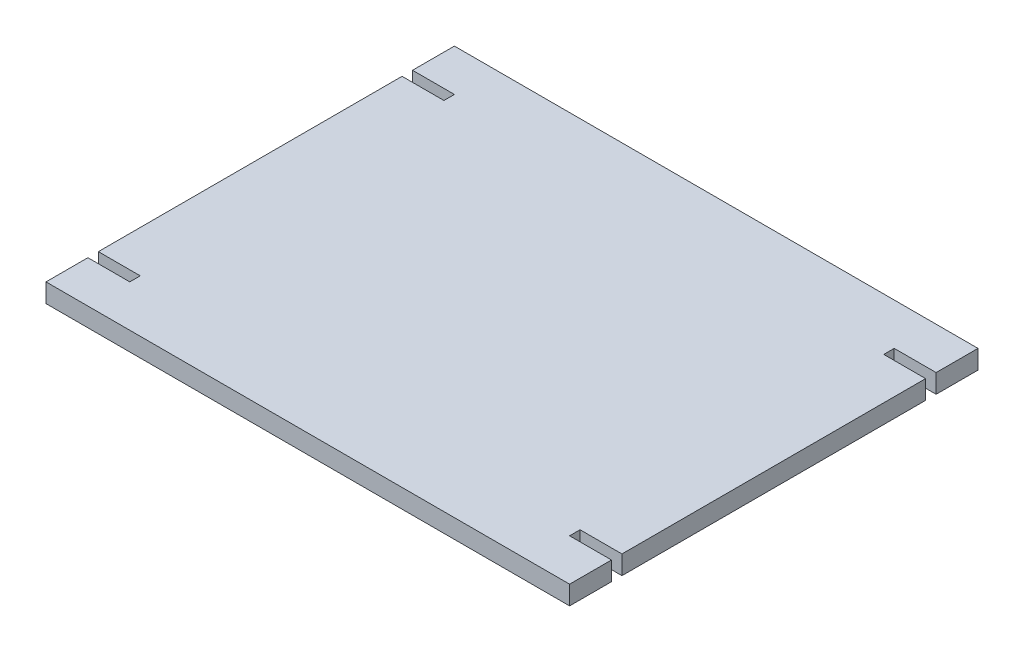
ISO-10303-21;
HEADER;
FILE_DESCRIPTION(('STEP AP214'),'2;1');
FILE_NAME('part.step','',(''),(''),'','','');
FILE_SCHEMA(('AUTOMOTIVE_DESIGN { 1 0 10303 214 1 1 1 1 }'));
ENDSEC;
DATA;
#1=APPLICATION_CONTEXT('core data for automotive mechanical design processes');
#2=APPLICATION_PROTOCOL_DEFINITION('international standard','automotive_design',2000,#1);
#3=PRODUCT_CONTEXT('',#1,'mechanical');
#4=PRODUCT('Part','Part','',(#3));
#5=PRODUCT_RELATED_PRODUCT_CATEGORY('part','',(#4));
#6=PRODUCT_DEFINITION_FORMATION('','',#4);
#7=PRODUCT_DEFINITION_CONTEXT('part definition',#1,'design');
#8=PRODUCT_DEFINITION('design','',#6,#7);
#9=PRODUCT_DEFINITION_SHAPE('','',#8);
#10=(LENGTH_UNIT() NAMED_UNIT(*) SI_UNIT(.MILLI.,.METRE.));
#11=(NAMED_UNIT(*) PLANE_ANGLE_UNIT() SI_UNIT($,.RADIAN.));
#12=(NAMED_UNIT(*) SI_UNIT($,.STERADIAN.) SOLID_ANGLE_UNIT());
#13=UNCERTAINTY_MEASURE_WITH_UNIT(LENGTH_MEASURE(1.E-05),#10,'distance_accuracy_value','');
#14=(GEOMETRIC_REPRESENTATION_CONTEXT(3) GLOBAL_UNCERTAINTY_ASSIGNED_CONTEXT((#13)) GLOBAL_UNIT_ASSIGNED_CONTEXT((#10,
#11,#12)) REPRESENTATION_CONTEXT('',''));
#15=CARTESIAN_POINT('',(0.,0.,0.));
#16=DIRECTION('',(0.,0.,1.));
#17=DIRECTION('',(1.,0.,0.));
#18=AXIS2_PLACEMENT_3D('',#15,#16,#17);
#19=CARTESIAN_POINT('',(-301.875,18.,-166.145833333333));
#20=DIRECTION('',(1.,0.,0.));
#21=DIRECTION('',(0.,0.,-1.));
#22=AXIS2_PLACEMENT_3D('',#19,#20,#21);
#23=PLANE('',#22);
#24=DIRECTION('',(0.,0.,1.));
#25=VECTOR('',#24,1.);
#26=CARTESIAN_POINT('',(-301.875,0.,-166.145833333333));
#27=LINE('',#26,#25);
#28=CARTESIAN_POINT('',(-301.875,0.,-206.145833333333));
#29=VERTEX_POINT('',#28);
#30=CARTESIAN_POINT('',(-301.875,0.,-166.145833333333));
#31=VERTEX_POINT('',#30);
#32=EDGE_CURVE('E201',#29,#31,#27,.T.);
#33=ORIENTED_EDGE('',*,*,#32,.T.);
#34=DIRECTION('',(0.,-1.,0.));
#35=VECTOR('',#34,1.);
#36=CARTESIAN_POINT('',(-301.875,18.,-166.145833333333));
#37=LINE('',#36,#35);
#38=CARTESIAN_POINT('',(-301.875,18.,-166.145833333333));
#39=VERTEX_POINT('',#38);
#40=EDGE_CURVE('E11',#39,#31,#37,.T.);
#41=ORIENTED_EDGE('',*,*,#40,.F.);
#42=DIRECTION('',(0.,0.,1.));
#43=VECTOR('',#42,1.);
#44=CARTESIAN_POINT('',(-301.875,18.,-166.145833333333));
#45=LINE('',#44,#43);
#46=CARTESIAN_POINT('',(-301.875,18.,-206.145833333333));
#47=VERTEX_POINT('',#46);
#48=EDGE_CURVE('E239',#47,#39,#45,.T.);
#49=ORIENTED_EDGE('',*,*,#48,.F.);
#50=DIRECTION('',(0.,-1.,0.));
#51=VECTOR('',#50,1.);
#52=CARTESIAN_POINT('',(-301.875,18.,-206.145833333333));
#53=LINE('',#52,#51);
#54=EDGE_CURVE('E197',#47,#29,#53,.T.);
#55=ORIENTED_EDGE('',*,*,#54,.T.);
#56=EDGE_LOOP('',(#33,#41,#49,#55));
#57=FACE_BOUND('',#56,.T.);
#58=ADVANCED_FACE('F33',(#57),#23,.F.);
#59=CARTESIAN_POINT('',(-261.875,18.,-166.145833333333));
#60=DIRECTION('',(0.,0.,-1.));
#61=DIRECTION('',(-1.,0.,0.));
#62=AXIS2_PLACEMENT_3D('',#59,#60,#61);
#63=PLANE('',#62);
#64=DIRECTION('',(1.,0.,0.));
#65=VECTOR('',#64,1.);
#66=CARTESIAN_POINT('',(-261.875,0.,-166.145833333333));
#67=LINE('',#66,#65);
#68=CARTESIAN_POINT('',(-261.875,0.,-166.145833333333));
#69=VERTEX_POINT('',#68);
#70=EDGE_CURVE('E204',#31,#69,#67,.T.);
#71=ORIENTED_EDGE('',*,*,#70,.T.);
#72=DIRECTION('',(0.,-1.,0.));
#73=VECTOR('',#72,1.);
#74=CARTESIAN_POINT('',(-261.875,18.,-166.145833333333));
#75=LINE('',#74,#73);
#76=CARTESIAN_POINT('',(-261.875,18.,-166.145833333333));
#77=VERTEX_POINT('',#76);
#78=EDGE_CURVE('E41',#77,#69,#75,.T.);
#79=ORIENTED_EDGE('',*,*,#78,.F.);
#80=DIRECTION('',(1.,0.,0.));
#81=VECTOR('',#80,1.);
#82=CARTESIAN_POINT('',(-261.875,18.,-166.145833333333));
#83=LINE('',#82,#81);
#84=EDGE_CURVE('E128',#39,#77,#83,.T.);
#85=ORIENTED_EDGE('',*,*,#84,.F.);
#86=ORIENTED_EDGE('',*,*,#40,.T.);
#87=EDGE_LOOP('',(#71,#79,#85,#86));
#88=FACE_BOUND('',#87,.T.);
#89=ADVANCED_FACE('F357',(#88),#63,.F.);
#90=CARTESIAN_POINT('',(-261.875,18.,-156.145833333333));
#91=DIRECTION('',(1.,0.,0.));
#92=DIRECTION('',(0.,0.,-1.));
#93=AXIS2_PLACEMENT_3D('',#90,#91,#92);
#94=PLANE('',#93);
#95=DIRECTION('',(0.,0.,1.));
#96=VECTOR('',#95,1.);
#97=CARTESIAN_POINT('',(-261.875,0.,-156.145833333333));
#98=LINE('',#97,#96);
#99=CARTESIAN_POINT('',(-261.875,0.,-156.145833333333));
#100=VERTEX_POINT('',#99);
#101=EDGE_CURVE('E206',#69,#100,#98,.T.);
#102=ORIENTED_EDGE('',*,*,#101,.T.);
#103=DIRECTION('',(0.,-1.,0.));
#104=VECTOR('',#103,1.);
#105=CARTESIAN_POINT('',(-261.875,18.,-156.145833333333));
#106=LINE('',#105,#104);
#107=CARTESIAN_POINT('',(-261.875,18.,-156.145833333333));
#108=VERTEX_POINT('',#107);
#109=EDGE_CURVE('E282',#108,#100,#106,.T.);
#110=ORIENTED_EDGE('',*,*,#109,.F.);
#111=DIRECTION('',(0.,0.,1.));
#112=VECTOR('',#111,1.);
#113=CARTESIAN_POINT('',(-261.875,18.,-156.145833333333));
#114=LINE('',#113,#112);
#115=EDGE_CURVE('E290',#77,#108,#114,.T.);
#116=ORIENTED_EDGE('',*,*,#115,.F.);
#117=ORIENTED_EDGE('',*,*,#78,.T.);
#118=EDGE_LOOP('',(#102,#110,#116,#117));
#119=FACE_BOUND('',#118,.T.);
#120=ADVANCED_FACE('F288',(#119),#94,.F.);
#121=CARTESIAN_POINT('',(-301.875,18.,-156.145833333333));
#122=DIRECTION('',(0.,0.,1.));
#123=DIRECTION('',(1.,0.,0.));
#124=AXIS2_PLACEMENT_3D('',#121,#122,#123);
#125=PLANE('',#124);
#126=DIRECTION('',(-1.,0.,0.));
#127=VECTOR('',#126,1.);
#128=CARTESIAN_POINT('',(-301.875,0.,-156.145833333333));
#129=LINE('',#128,#127);
#130=CARTESIAN_POINT('',(-301.875,0.,-156.145833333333));
#131=VERTEX_POINT('',#130);
#132=EDGE_CURVE('E208',#100,#131,#129,.T.);
#133=ORIENTED_EDGE('',*,*,#132,.T.);
#134=DIRECTION('',(0.,-1.,0.));
#135=VECTOR('',#134,1.);
#136=CARTESIAN_POINT('',(-301.875,18.,-156.145833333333));
#137=LINE('',#136,#135);
#138=CARTESIAN_POINT('',(-301.875,18.,-156.145833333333));
#139=VERTEX_POINT('',#138);
#140=EDGE_CURVE('E279',#139,#131,#137,.T.);
#141=ORIENTED_EDGE('',*,*,#140,.F.);
#142=DIRECTION('',(-1.,0.,0.));
#143=VECTOR('',#142,1.);
#144=CARTESIAN_POINT('',(-301.875,18.,-156.145833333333));
#145=LINE('',#144,#143);
#146=EDGE_CURVE('E308',#108,#139,#145,.T.);
#147=ORIENTED_EDGE('',*,*,#146,.F.);
#148=ORIENTED_EDGE('',*,*,#109,.T.);
#149=EDGE_LOOP('',(#133,#141,#147,#148));
#150=FACE_BOUND('',#149,.T.);
#151=ADVANCED_FACE('F299',(#150),#125,.F.);
#152=CARTESIAN_POINT('',(-301.875,18.,133.854166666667));
#153=DIRECTION('',(1.,0.,0.));
#154=DIRECTION('',(0.,0.,-1.));
#155=AXIS2_PLACEMENT_3D('',#152,#153,#154);
#156=PLANE('',#155);
#157=DIRECTION('',(0.,0.,1.));
#158=VECTOR('',#157,1.);
#159=CARTESIAN_POINT('',(-301.875,0.,133.854166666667));
#160=LINE('',#159,#158);
#161=CARTESIAN_POINT('',(-301.875,0.,133.854166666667));
#162=VERTEX_POINT('',#161);
#163=EDGE_CURVE('E210',#131,#162,#160,.T.);
#164=ORIENTED_EDGE('',*,*,#163,.T.);
#165=DIRECTION('',(0.,-1.,0.));
#166=VECTOR('',#165,1.);
#167=CARTESIAN_POINT('',(-301.875,18.,133.854166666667));
#168=LINE('',#167,#166);
#169=CARTESIAN_POINT('',(-301.875,18.,133.854166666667));
#170=VERTEX_POINT('',#169);
#171=EDGE_CURVE('E276',#170,#162,#168,.T.);
#172=ORIENTED_EDGE('',*,*,#171,.F.);
#173=DIRECTION('',(0.,0.,1.));
#174=VECTOR('',#173,1.);
#175=CARTESIAN_POINT('',(-301.875,18.,133.854166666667));
#176=LINE('',#175,#174);
#177=EDGE_CURVE('E305',#139,#170,#176,.T.);
#178=ORIENTED_EDGE('',*,*,#177,.F.);
#179=ORIENTED_EDGE('',*,*,#140,.T.);
#180=EDGE_LOOP('',(#164,#172,#178,#179));
#181=FACE_BOUND('',#180,.T.);
#182=ADVANCED_FACE('F303',(#181),#156,.F.);
#183=CARTESIAN_POINT('',(-261.875,18.,133.854166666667));
#184=DIRECTION('',(0.,0.,-1.));
#185=DIRECTION('',(-1.,0.,0.));
#186=AXIS2_PLACEMENT_3D('',#183,#184,#185);
#187=PLANE('',#186);
#188=DIRECTION('',(1.,0.,0.));
#189=VECTOR('',#188,1.);
#190=CARTESIAN_POINT('',(-261.875,0.,133.854166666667));
#191=LINE('',#190,#189);
#192=CARTESIAN_POINT('',(-261.875,0.,133.854166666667));
#193=VERTEX_POINT('',#192);
#194=EDGE_CURVE('E212',#162,#193,#191,.T.);
#195=ORIENTED_EDGE('',*,*,#194,.T.);
#196=DIRECTION('',(0.,-1.,0.));
#197=VECTOR('',#196,1.);
#198=CARTESIAN_POINT('',(-261.875,18.,133.854166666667));
#199=LINE('',#198,#197);
#200=CARTESIAN_POINT('',(-261.875,18.,133.854166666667));
#201=VERTEX_POINT('',#200);
#202=EDGE_CURVE('E273',#201,#193,#199,.T.);
#203=ORIENTED_EDGE('',*,*,#202,.F.);
#204=DIRECTION('',(1.,0.,0.));
#205=VECTOR('',#204,1.);
#206=CARTESIAN_POINT('',(-261.875,18.,133.854166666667));
#207=LINE('',#206,#205);
#208=EDGE_CURVE('E307',#170,#201,#207,.T.);
#209=ORIENTED_EDGE('',*,*,#208,.F.);
#210=ORIENTED_EDGE('',*,*,#171,.T.);
#211=EDGE_LOOP('',(#195,#203,#209,#210));
#212=FACE_BOUND('',#211,.T.);
#213=ADVANCED_FACE('F370',(#212),#187,.F.);
#214=CARTESIAN_POINT('',(-261.875,18.,143.854166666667));
#215=DIRECTION('',(1.,0.,0.));
#216=DIRECTION('',(0.,0.,-1.));
#217=AXIS2_PLACEMENT_3D('',#214,#215,#216);
#218=PLANE('',#217);
#219=DIRECTION('',(0.,0.,1.));
#220=VECTOR('',#219,1.);
#221=CARTESIAN_POINT('',(-261.875,0.,143.854166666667));
#222=LINE('',#221,#220);
#223=CARTESIAN_POINT('',(-261.875,0.,143.854166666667));
#224=VERTEX_POINT('',#223);
#225=EDGE_CURVE('E214',#193,#224,#222,.T.);
#226=ORIENTED_EDGE('',*,*,#225,.T.);
#227=DIRECTION('',(0.,-1.,0.));
#228=VECTOR('',#227,1.);
#229=CARTESIAN_POINT('',(-261.875,18.,143.854166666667));
#230=LINE('',#229,#228);
#231=CARTESIAN_POINT('',(-261.875,18.,143.854166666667));
#232=VERTEX_POINT('',#231);
#233=EDGE_CURVE('E270',#232,#224,#230,.T.);
#234=ORIENTED_EDGE('',*,*,#233,.F.);
#235=DIRECTION('',(0.,0.,1.));
#236=VECTOR('',#235,1.);
#237=CARTESIAN_POINT('',(-261.875,18.,143.854166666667));
#238=LINE('',#237,#236);
#239=EDGE_CURVE('E310',#201,#232,#238,.T.);
#240=ORIENTED_EDGE('',*,*,#239,.F.);
#241=ORIENTED_EDGE('',*,*,#202,.T.);
#242=EDGE_LOOP('',(#226,#234,#240,#241));
#243=FACE_BOUND('',#242,.T.);
#244=ADVANCED_FACE('F373',(#243),#218,.F.);
#245=CARTESIAN_POINT('',(-301.875,18.,143.854166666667));
#246=DIRECTION('',(0.,0.,1.));
#247=DIRECTION('',(1.,0.,0.));
#248=AXIS2_PLACEMENT_3D('',#245,#246,#247);
#249=PLANE('',#248);
#250=DIRECTION('',(-1.,0.,0.));
#251=VECTOR('',#250,1.);
#252=CARTESIAN_POINT('',(-301.875,0.,143.854166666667));
#253=LINE('',#252,#251);
#254=CARTESIAN_POINT('',(-301.875,0.,143.854166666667));
#255=VERTEX_POINT('',#254);
#256=EDGE_CURVE('E216',#224,#255,#253,.T.);
#257=ORIENTED_EDGE('',*,*,#256,.T.);
#258=DIRECTION('',(0.,-1.,0.));
#259=VECTOR('',#258,1.);
#260=CARTESIAN_POINT('',(-301.875,18.,143.854166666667));
#261=LINE('',#260,#259);
#262=CARTESIAN_POINT('',(-301.875,18.,143.854166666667));
#263=VERTEX_POINT('',#262);
#264=EDGE_CURVE('E267',#263,#255,#261,.T.);
#265=ORIENTED_EDGE('',*,*,#264,.F.);
#266=DIRECTION('',(-1.,0.,0.));
#267=VECTOR('',#266,1.);
#268=CARTESIAN_POINT('',(-301.875,18.,143.854166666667));
#269=LINE('',#268,#267);
#270=EDGE_CURVE('E316',#232,#263,#269,.T.);
#271=ORIENTED_EDGE('',*,*,#270,.F.);
#272=ORIENTED_EDGE('',*,*,#233,.T.);
#273=EDGE_LOOP('',(#257,#265,#271,#272));
#274=FACE_BOUND('',#273,.T.);
#275=ADVANCED_FACE('F377',(#274),#249,.F.);
#276=CARTESIAN_POINT('',(-301.875,18.,183.854166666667));
#277=DIRECTION('',(1.,0.,0.));
#278=DIRECTION('',(0.,0.,-1.));
#279=AXIS2_PLACEMENT_3D('',#276,#277,#278);
#280=PLANE('',#279);
#281=DIRECTION('',(0.,0.,1.));
#282=VECTOR('',#281,1.);
#283=CARTESIAN_POINT('',(-301.875,0.,183.854166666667));
#284=LINE('',#283,#282);
#285=CARTESIAN_POINT('',(-301.875,0.,183.854166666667));
#286=VERTEX_POINT('',#285);
#287=EDGE_CURVE('E218',#255,#286,#284,.T.);
#288=ORIENTED_EDGE('',*,*,#287,.T.);
#289=DIRECTION('',(0.,-1.,0.));
#290=VECTOR('',#289,1.);
#291=CARTESIAN_POINT('',(-301.875,18.,183.854166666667));
#292=LINE('',#291,#290);
#293=CARTESIAN_POINT('',(-301.875,18.,183.854166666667));
#294=VERTEX_POINT('',#293);
#295=EDGE_CURVE('E264',#294,#286,#292,.T.);
#296=ORIENTED_EDGE('',*,*,#295,.F.);
#297=DIRECTION('',(0.,0.,1.));
#298=VECTOR('',#297,1.);
#299=CARTESIAN_POINT('',(-301.875,18.,183.854166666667));
#300=LINE('',#299,#298);
#301=EDGE_CURVE('E318',#263,#294,#300,.T.);
#302=ORIENTED_EDGE('',*,*,#301,.F.);
#303=ORIENTED_EDGE('',*,*,#264,.T.);
#304=EDGE_LOOP('',(#288,#296,#302,#303));
#305=FACE_BOUND('',#304,.T.);
#306=ADVANCED_FACE('F381',(#305),#280,.F.);
#307=CARTESIAN_POINT('',(198.125,18.,183.854166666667));
#308=DIRECTION('',(0.,0.,-1.));
#309=DIRECTION('',(-1.,0.,0.));
#310=AXIS2_PLACEMENT_3D('',#307,#308,#309);
#311=PLANE('',#310);
#312=DIRECTION('',(1.,0.,0.));
#313=VECTOR('',#312,1.);
#314=CARTESIAN_POINT('',(198.125,0.,183.854166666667));
#315=LINE('',#314,#313);
#316=CARTESIAN_POINT('',(198.125,0.,183.854166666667));
#317=VERTEX_POINT('',#316);
#318=EDGE_CURVE('E220',#286,#317,#315,.T.);
#319=ORIENTED_EDGE('',*,*,#318,.T.);
#320=DIRECTION('',(0.,-1.,0.));
#321=VECTOR('',#320,1.);
#322=CARTESIAN_POINT('',(198.125,18.,183.854166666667));
#323=LINE('',#322,#321);
#324=CARTESIAN_POINT('',(198.125,18.,183.854166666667));
#325=VERTEX_POINT('',#324);
#326=EDGE_CURVE('E261',#325,#317,#323,.T.);
#327=ORIENTED_EDGE('',*,*,#326,.F.);
#328=DIRECTION('',(1.,0.,0.));
#329=VECTOR('',#328,1.);
#330=CARTESIAN_POINT('',(198.125,18.,183.854166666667));
#331=LINE('',#330,#329);
#332=EDGE_CURVE('E320',#294,#325,#331,.T.);
#333=ORIENTED_EDGE('',*,*,#332,.F.);
#334=ORIENTED_EDGE('',*,*,#295,.T.);
#335=EDGE_LOOP('',(#319,#327,#333,#334));
#336=FACE_BOUND('',#335,.T.);
#337=ADVANCED_FACE('F385',(#336),#311,.F.);
#338=CARTESIAN_POINT('',(198.125,18.,143.854166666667));
#339=DIRECTION('',(-1.,0.,0.));
#340=DIRECTION('',(0.,0.,1.));
#341=AXIS2_PLACEMENT_3D('',#338,#339,#340);
#342=PLANE('',#341);
#343=DIRECTION('',(0.,0.,-1.));
#344=VECTOR('',#343,1.);
#345=CARTESIAN_POINT('',(198.125,0.,143.854166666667));
#346=LINE('',#345,#344);
#347=CARTESIAN_POINT('',(198.125,0.,143.854166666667));
#348=VERTEX_POINT('',#347);
#349=EDGE_CURVE('E222',#317,#348,#346,.T.);
#350=ORIENTED_EDGE('',*,*,#349,.T.);
#351=DIRECTION('',(0.,-1.,0.));
#352=VECTOR('',#351,1.);
#353=CARTESIAN_POINT('',(198.125,18.,143.854166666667));
#354=LINE('',#353,#352);
#355=CARTESIAN_POINT('',(198.125,18.,143.854166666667));
#356=VERTEX_POINT('',#355);
#357=EDGE_CURVE('E258',#356,#348,#354,.T.);
#358=ORIENTED_EDGE('',*,*,#357,.F.);
#359=DIRECTION('',(0.,0.,-1.));
#360=VECTOR('',#359,1.);
#361=CARTESIAN_POINT('',(198.125,18.,143.854166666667));
#362=LINE('',#361,#360);
#363=EDGE_CURVE('E322',#325,#356,#362,.T.);
#364=ORIENTED_EDGE('',*,*,#363,.F.);
#365=ORIENTED_EDGE('',*,*,#326,.T.);
#366=EDGE_LOOP('',(#350,#358,#364,#365));
#367=FACE_BOUND('',#366,.T.);
#368=ADVANCED_FACE('F389',(#367),#342,.F.);
#369=CARTESIAN_POINT('',(158.125,18.,143.854166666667));
#370=DIRECTION('',(0.,0.,1.));
#371=DIRECTION('',(1.,0.,0.));
#372=AXIS2_PLACEMENT_3D('',#369,#370,#371);
#373=PLANE('',#372);
#374=DIRECTION('',(-1.,0.,0.));
#375=VECTOR('',#374,1.);
#376=CARTESIAN_POINT('',(158.125,0.,143.854166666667));
#377=LINE('',#376,#375);
#378=CARTESIAN_POINT('',(158.125,0.,143.854166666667));
#379=VERTEX_POINT('',#378);
#380=EDGE_CURVE('E224',#348,#379,#377,.T.);
#381=ORIENTED_EDGE('',*,*,#380,.T.);
#382=DIRECTION('',(0.,-1.,0.));
#383=VECTOR('',#382,1.);
#384=CARTESIAN_POINT('',(158.125,18.,143.854166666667));
#385=LINE('',#384,#383);
#386=CARTESIAN_POINT('',(158.125,18.,143.854166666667));
#387=VERTEX_POINT('',#386);
#388=EDGE_CURVE('E255',#387,#379,#385,.T.);
#389=ORIENTED_EDGE('',*,*,#388,.F.);
#390=DIRECTION('',(-1.,0.,0.));
#391=VECTOR('',#390,1.);
#392=CARTESIAN_POINT('',(158.125,18.,143.854166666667));
#393=LINE('',#392,#391);
#394=EDGE_CURVE('E324',#356,#387,#393,.T.);
#395=ORIENTED_EDGE('',*,*,#394,.F.);
#396=ORIENTED_EDGE('',*,*,#357,.T.);
#397=EDGE_LOOP('',(#381,#389,#395,#396));
#398=FACE_BOUND('',#397,.T.);
#399=ADVANCED_FACE('F393',(#398),#373,.F.);
#400=CARTESIAN_POINT('',(158.125,18.,133.854166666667));
#401=DIRECTION('',(-1.,0.,0.));
#402=DIRECTION('',(0.,0.,1.));
#403=AXIS2_PLACEMENT_3D('',#400,#401,#402);
#404=PLANE('',#403);
#405=DIRECTION('',(0.,0.,-1.));
#406=VECTOR('',#405,1.);
#407=CARTESIAN_POINT('',(158.125,0.,133.854166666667));
#408=LINE('',#407,#406);
#409=CARTESIAN_POINT('',(158.125,0.,133.854166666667));
#410=VERTEX_POINT('',#409);
#411=EDGE_CURVE('E226',#379,#410,#408,.T.);
#412=ORIENTED_EDGE('',*,*,#411,.T.);
#413=DIRECTION('',(0.,-1.,0.));
#414=VECTOR('',#413,1.);
#415=CARTESIAN_POINT('',(158.125,18.,133.854166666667));
#416=LINE('',#415,#414);
#417=CARTESIAN_POINT('',(158.125,18.,133.854166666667));
#418=VERTEX_POINT('',#417);
#419=EDGE_CURVE('E252',#418,#410,#416,.T.);
#420=ORIENTED_EDGE('',*,*,#419,.F.);
#421=DIRECTION('',(0.,0.,-1.));
#422=VECTOR('',#421,1.);
#423=CARTESIAN_POINT('',(158.125,18.,133.854166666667));
#424=LINE('',#423,#422);
#425=EDGE_CURVE('E326',#387,#418,#424,.T.);
#426=ORIENTED_EDGE('',*,*,#425,.F.);
#427=ORIENTED_EDGE('',*,*,#388,.T.);
#428=EDGE_LOOP('',(#412,#420,#426,#427));
#429=FACE_BOUND('',#428,.T.);
#430=ADVANCED_FACE('F397',(#429),#404,.F.);
#431=CARTESIAN_POINT('',(198.125,18.,133.854166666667));
#432=DIRECTION('',(0.,0.,-1.));
#433=DIRECTION('',(-1.,0.,0.));
#434=AXIS2_PLACEMENT_3D('',#431,#432,#433);
#435=PLANE('',#434);
#436=DIRECTION('',(1.,0.,0.));
#437=VECTOR('',#436,1.);
#438=CARTESIAN_POINT('',(198.125,0.,133.854166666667));
#439=LINE('',#438,#437);
#440=CARTESIAN_POINT('',(198.125,0.,133.854166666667));
#441=VERTEX_POINT('',#440);
#442=EDGE_CURVE('E228',#410,#441,#439,.T.);
#443=ORIENTED_EDGE('',*,*,#442,.T.);
#444=DIRECTION('',(0.,-1.,0.));
#445=VECTOR('',#444,1.);
#446=CARTESIAN_POINT('',(198.125,18.,133.854166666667));
#447=LINE('',#446,#445);
#448=CARTESIAN_POINT('',(198.125,18.,133.854166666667));
#449=VERTEX_POINT('',#448);
#450=EDGE_CURVE('E249',#449,#441,#447,.T.);
#451=ORIENTED_EDGE('',*,*,#450,.F.);
#452=DIRECTION('',(1.,0.,0.));
#453=VECTOR('',#452,1.);
#454=CARTESIAN_POINT('',(198.125,18.,133.854166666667));
#455=LINE('',#454,#453);
#456=EDGE_CURVE('E328',#418,#449,#455,.T.);
#457=ORIENTED_EDGE('',*,*,#456,.F.);
#458=ORIENTED_EDGE('',*,*,#419,.T.);
#459=EDGE_LOOP('',(#443,#451,#457,#458));
#460=FACE_BOUND('',#459,.T.);
#461=ADVANCED_FACE('F401',(#460),#435,.F.);
#462=CARTESIAN_POINT('',(198.125,18.,-156.145833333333));
#463=DIRECTION('',(-1.,0.,0.));
#464=DIRECTION('',(0.,0.,1.));
#465=AXIS2_PLACEMENT_3D('',#462,#463,#464);
#466=PLANE('',#465);
#467=DIRECTION('',(0.,0.,-1.));
#468=VECTOR('',#467,1.);
#469=CARTESIAN_POINT('',(198.125,0.,-156.145833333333));
#470=LINE('',#469,#468);
#471=CARTESIAN_POINT('',(198.125,0.,-156.145833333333));
#472=VERTEX_POINT('',#471);
#473=EDGE_CURVE('E230',#441,#472,#470,.T.);
#474=ORIENTED_EDGE('',*,*,#473,.T.);
#475=DIRECTION('',(0.,-1.,0.));
#476=VECTOR('',#475,1.);
#477=CARTESIAN_POINT('',(198.125,18.,-156.145833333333));
#478=LINE('',#477,#476);
#479=CARTESIAN_POINT('',(198.125,18.,-156.145833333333));
#480=VERTEX_POINT('',#479);
#481=EDGE_CURVE('E246',#480,#472,#478,.T.);
#482=ORIENTED_EDGE('',*,*,#481,.F.);
#483=DIRECTION('',(0.,0.,-1.));
#484=VECTOR('',#483,1.);
#485=CARTESIAN_POINT('',(198.125,18.,-156.145833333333));
#486=LINE('',#485,#484);
#487=EDGE_CURVE('E330',#449,#480,#486,.T.);
#488=ORIENTED_EDGE('',*,*,#487,.F.);
#489=ORIENTED_EDGE('',*,*,#450,.T.);
#490=EDGE_LOOP('',(#474,#482,#488,#489));
#491=FACE_BOUND('',#490,.T.);
#492=ADVANCED_FACE('F405',(#491),#466,.F.);
#493=CARTESIAN_POINT('',(158.125,18.,-156.145833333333));
#494=DIRECTION('',(0.,0.,1.));
#495=DIRECTION('',(1.,0.,0.));
#496=AXIS2_PLACEMENT_3D('',#493,#494,#495);
#497=PLANE('',#496);
#498=DIRECTION('',(-1.,0.,0.));
#499=VECTOR('',#498,1.);
#500=CARTESIAN_POINT('',(158.125,0.,-156.145833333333));
#501=LINE('',#500,#499);
#502=CARTESIAN_POINT('',(158.125,0.,-156.145833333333));
#503=VERTEX_POINT('',#502);
#504=EDGE_CURVE('E232',#472,#503,#501,.T.);
#505=ORIENTED_EDGE('',*,*,#504,.T.);
#506=DIRECTION('',(0.,-1.,0.));
#507=VECTOR('',#506,1.);
#508=CARTESIAN_POINT('',(158.125,18.,-156.145833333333));
#509=LINE('',#508,#507);
#510=CARTESIAN_POINT('',(158.125,18.,-156.145833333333));
#511=VERTEX_POINT('',#510);
#512=EDGE_CURVE('E243',#511,#503,#509,.T.);
#513=ORIENTED_EDGE('',*,*,#512,.F.);
#514=DIRECTION('',(-1.,0.,0.));
#515=VECTOR('',#514,1.);
#516=CARTESIAN_POINT('',(158.125,18.,-156.145833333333));
#517=LINE('',#516,#515);
#518=EDGE_CURVE('E332',#480,#511,#517,.T.);
#519=ORIENTED_EDGE('',*,*,#518,.F.);
#520=ORIENTED_EDGE('',*,*,#481,.T.);
#521=EDGE_LOOP('',(#505,#513,#519,#520));
#522=FACE_BOUND('',#521,.T.);
#523=ADVANCED_FACE('F338',(#522),#497,.F.);
#524=CARTESIAN_POINT('',(158.125,18.,-166.145833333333));
#525=DIRECTION('',(-1.,0.,0.));
#526=DIRECTION('',(0.,0.,1.));
#527=AXIS2_PLACEMENT_3D('',#524,#525,#526);
#528=PLANE('',#527);
#529=DIRECTION('',(0.,0.,-1.));
#530=VECTOR('',#529,1.);
#531=CARTESIAN_POINT('',(158.125,0.,-166.145833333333));
#532=LINE('',#531,#530);
#533=CARTESIAN_POINT('',(158.125,0.,-166.145833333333));
#534=VERTEX_POINT('',#533);
#535=EDGE_CURVE('E234',#503,#534,#532,.T.);
#536=ORIENTED_EDGE('',*,*,#535,.T.);
#537=DIRECTION('',(0.,-1.,0.));
#538=VECTOR('',#537,1.);
#539=CARTESIAN_POINT('',(158.125,18.,-166.145833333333));
#540=LINE('',#539,#538);
#541=CARTESIAN_POINT('',(158.125,18.,-166.145833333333));
#542=VERTEX_POINT('',#541);
#543=EDGE_CURVE('E192',#542,#534,#540,.T.);
#544=ORIENTED_EDGE('',*,*,#543,.F.);
#545=DIRECTION('',(0.,0.,-1.));
#546=VECTOR('',#545,1.);
#547=CARTESIAN_POINT('',(158.125,18.,-166.145833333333));
#548=LINE('',#547,#546);
#549=EDGE_CURVE('E183',#511,#542,#548,.T.);
#550=ORIENTED_EDGE('',*,*,#549,.F.);
#551=ORIENTED_EDGE('',*,*,#512,.T.);
#552=EDGE_LOOP('',(#536,#544,#550,#551));
#553=FACE_BOUND('',#552,.T.);
#554=ADVANCED_FACE('F342',(#553),#528,.F.);
#555=CARTESIAN_POINT('',(198.125,18.,-166.145833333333));
#556=DIRECTION('',(0.,0.,-1.));
#557=DIRECTION('',(-1.,0.,0.));
#558=AXIS2_PLACEMENT_3D('',#555,#556,#557);
#559=PLANE('',#558);
#560=DIRECTION('',(1.,0.,0.));
#561=VECTOR('',#560,1.);
#562=CARTESIAN_POINT('',(198.125,0.,-166.145833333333));
#563=LINE('',#562,#561);
#564=CARTESIAN_POINT('',(198.125,0.,-166.145833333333));
#565=VERTEX_POINT('',#564);
#566=EDGE_CURVE('E191',#534,#565,#563,.T.);
#567=ORIENTED_EDGE('',*,*,#566,.T.);
#568=DIRECTION('',(0.,-1.,0.));
#569=VECTOR('',#568,1.);
#570=CARTESIAN_POINT('',(198.125,18.,-166.145833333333));
#571=LINE('',#570,#569);
#572=CARTESIAN_POINT('',(198.125,18.,-166.145833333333));
#573=VERTEX_POINT('',#572);
#574=EDGE_CURVE('E188',#573,#565,#571,.T.);
#575=ORIENTED_EDGE('',*,*,#574,.F.);
#576=DIRECTION('',(1.,0.,0.));
#577=VECTOR('',#576,1.);
#578=CARTESIAN_POINT('',(198.125,18.,-166.145833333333));
#579=LINE('',#578,#577);
#580=EDGE_CURVE('E177',#542,#573,#579,.T.);
#581=ORIENTED_EDGE('',*,*,#580,.F.);
#582=ORIENTED_EDGE('',*,*,#543,.T.);
#583=EDGE_LOOP('',(#567,#575,#581,#582));
#584=FACE_BOUND('',#583,.T.);
#585=ADVANCED_FACE('F189',(#584),#559,.F.);
#586=CARTESIAN_POINT('',(198.125,18.,-206.145833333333));
#587=DIRECTION('',(-1.,0.,0.));
#588=DIRECTION('',(0.,0.,1.));
#589=AXIS2_PLACEMENT_3D('',#586,#587,#588);
#590=PLANE('',#589);
#591=DIRECTION('',(0.,0.,-1.));
#592=VECTOR('',#591,1.);
#593=CARTESIAN_POINT('',(198.125,0.,-206.145833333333));
#594=LINE('',#593,#592);
#595=CARTESIAN_POINT('',(198.125,0.,-206.145833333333));
#596=VERTEX_POINT('',#595);
#597=EDGE_CURVE('E114',#565,#596,#594,.T.);
#598=ORIENTED_EDGE('',*,*,#597,.T.);
#599=DIRECTION('',(0.,-1.,0.));
#600=VECTOR('',#599,1.);
#601=CARTESIAN_POINT('',(198.125,18.,-206.145833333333));
#602=LINE('',#601,#600);
#603=CARTESIAN_POINT('',(198.125,18.,-206.145833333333));
#604=VERTEX_POINT('',#603);
#605=EDGE_CURVE('E193',#604,#596,#602,.T.);
#606=ORIENTED_EDGE('',*,*,#605,.F.);
#607=DIRECTION('',(0.,0.,-1.));
#608=VECTOR('',#607,1.);
#609=CARTESIAN_POINT('',(198.125,18.,-206.145833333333));
#610=LINE('',#609,#608);
#611=EDGE_CURVE('E181',#573,#604,#610,.T.);
#612=ORIENTED_EDGE('',*,*,#611,.F.);
#613=ORIENTED_EDGE('',*,*,#574,.T.);
#614=EDGE_LOOP('',(#598,#606,#612,#613));
#615=FACE_BOUND('',#614,.T.);
#616=ADVANCED_FACE('F195',(#615),#590,.F.);
#617=CARTESIAN_POINT('',(-301.875,18.,-206.145833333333));
#618=DIRECTION('',(0.,0.,1.));
#619=DIRECTION('',(1.,0.,0.));
#620=AXIS2_PLACEMENT_3D('',#617,#618,#619);
#621=PLANE('',#620);
#622=DIRECTION('',(-1.,0.,0.));
#623=VECTOR('',#622,1.);
#624=CARTESIAN_POINT('',(-301.875,0.,-206.145833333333));
#625=LINE('',#624,#623);
#626=EDGE_CURVE('E120',#596,#29,#625,.T.);
#627=ORIENTED_EDGE('',*,*,#626,.T.);
#628=ORIENTED_EDGE('',*,*,#54,.F.);
#629=DIRECTION('',(-1.,0.,0.));
#630=VECTOR('',#629,1.);
#631=CARTESIAN_POINT('',(-301.875,18.,-206.145833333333));
#632=LINE('',#631,#630);
#633=EDGE_CURVE('E49',#604,#47,#632,.T.);
#634=ORIENTED_EDGE('',*,*,#633,.F.);
#635=ORIENTED_EDGE('',*,*,#605,.T.);
#636=EDGE_LOOP('',(#627,#628,#634,#635));
#637=FACE_BOUND('',#636,.T.);
#638=ADVANCED_FACE('F346',(#637),#621,.F.);
#639=CARTESIAN_POINT('',(0.,18.,0.));
#640=DIRECTION('',(0.,-1.,0.));
#641=DIRECTION('',(0.,0.,-1.));
#642=AXIS2_PLACEMENT_3D('',#639,#640,#641);
#643=PLANE('',#642);
#644=ORIENTED_EDGE('',*,*,#48,.T.);
#645=ORIENTED_EDGE('',*,*,#84,.T.);
#646=ORIENTED_EDGE('',*,*,#115,.T.);
#647=ORIENTED_EDGE('',*,*,#146,.T.);
#648=ORIENTED_EDGE('',*,*,#177,.T.);
#649=ORIENTED_EDGE('',*,*,#208,.T.);
#650=ORIENTED_EDGE('',*,*,#239,.T.);
#651=ORIENTED_EDGE('',*,*,#270,.T.);
#652=ORIENTED_EDGE('',*,*,#301,.T.);
#653=ORIENTED_EDGE('',*,*,#332,.T.);
#654=ORIENTED_EDGE('',*,*,#363,.T.);
#655=ORIENTED_EDGE('',*,*,#394,.T.);
#656=ORIENTED_EDGE('',*,*,#425,.T.);
#657=ORIENTED_EDGE('',*,*,#456,.T.);
#658=ORIENTED_EDGE('',*,*,#487,.T.);
#659=ORIENTED_EDGE('',*,*,#518,.T.);
#660=ORIENTED_EDGE('',*,*,#549,.T.);
#661=ORIENTED_EDGE('',*,*,#580,.T.);
#662=ORIENTED_EDGE('',*,*,#611,.T.);
#663=ORIENTED_EDGE('',*,*,#633,.T.);
#664=EDGE_LOOP('',(#644,#645,#646,#647,#648,#649,#650,#651,#652,#653,#654,#655,#656,#657,#658,
#659,#660,#661,#662,#663));
#665=FACE_BOUND('',#664,.T.);
#666=ADVANCED_FACE('F179',(#665),#643,.F.);
#667=CARTESIAN_POINT('',(0.,0.,0.));
#668=DIRECTION('',(0.,-1.,0.));
#669=DIRECTION('',(0.,0.,-1.));
#670=AXIS2_PLACEMENT_3D('',#667,#668,#669);
#671=PLANE('',#670);
#672=ORIENTED_EDGE('',*,*,#32,.F.);
#673=ORIENTED_EDGE('',*,*,#626,.F.);
#674=ORIENTED_EDGE('',*,*,#597,.F.);
#675=ORIENTED_EDGE('',*,*,#566,.F.);
#676=ORIENTED_EDGE('',*,*,#535,.F.);
#677=ORIENTED_EDGE('',*,*,#504,.F.);
#678=ORIENTED_EDGE('',*,*,#473,.F.);
#679=ORIENTED_EDGE('',*,*,#442,.F.);
#680=ORIENTED_EDGE('',*,*,#411,.F.);
#681=ORIENTED_EDGE('',*,*,#380,.F.);
#682=ORIENTED_EDGE('',*,*,#349,.F.);
#683=ORIENTED_EDGE('',*,*,#318,.F.);
#684=ORIENTED_EDGE('',*,*,#287,.F.);
#685=ORIENTED_EDGE('',*,*,#256,.F.);
#686=ORIENTED_EDGE('',*,*,#225,.F.);
#687=ORIENTED_EDGE('',*,*,#194,.F.);
#688=ORIENTED_EDGE('',*,*,#163,.F.);
#689=ORIENTED_EDGE('',*,*,#132,.F.);
#690=ORIENTED_EDGE('',*,*,#101,.F.);
#691=ORIENTED_EDGE('',*,*,#70,.F.);
#692=EDGE_LOOP('',(#672,#673,#674,#675,#676,#677,#678,#679,#680,#681,#682,#683,#684,#685,#686,
#687,#688,#689,#690,#691));
#693=FACE_BOUND('',#692,.T.);
#694=ADVANCED_FACE('F294',(#693),#671,.T.);
#695=CLOSED_SHELL('',(#58,#89,#120,#151,#182,#213,#244,#275,#306,#337,#368,#399,#430,#461,#492,
#523,#554,#585,#616,#638,#666,#694));
#696=MANIFOLD_SOLID_BREP('B2',#695);
#697=ADVANCED_BREP_SHAPE_REPRESENTATION('',(#18,#696),#14);
#698=SHAPE_DEFINITION_REPRESENTATION(#9,#697);
ENDSEC;
END-ISO-10303-21;
